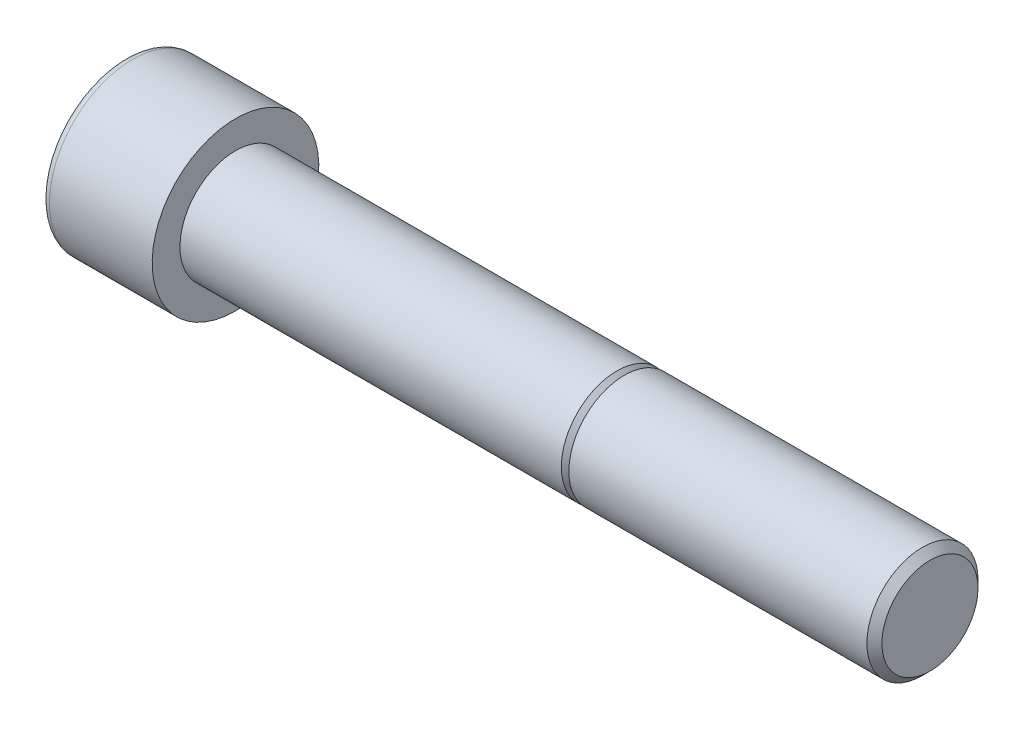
ISO-10303-21;
HEADER;
FILE_DESCRIPTION(('STEP AP214'),'2;1');
FILE_NAME('part.step','',(''),(''),'','','');
FILE_SCHEMA(('AUTOMOTIVE_DESIGN { 1 0 10303 214 1 1 1 1 }'));
ENDSEC;
DATA;
#1=APPLICATION_CONTEXT('core data for automotive mechanical design processes');
#2=APPLICATION_PROTOCOL_DEFINITION('international standard','automotive_design',2000,#1);
#3=PRODUCT_CONTEXT('',#1,'mechanical');
#4=PRODUCT('Part','Part','',(#3));
#5=PRODUCT_RELATED_PRODUCT_CATEGORY('part','',(#4));
#6=PRODUCT_DEFINITION_FORMATION('','',#4);
#7=PRODUCT_DEFINITION_CONTEXT('part definition',#1,'design');
#8=PRODUCT_DEFINITION('design','',#6,#7);
#9=PRODUCT_DEFINITION_SHAPE('','',#8);
#10=(LENGTH_UNIT() NAMED_UNIT(*) SI_UNIT(.MILLI.,.METRE.));
#11=(NAMED_UNIT(*) PLANE_ANGLE_UNIT() SI_UNIT($,.RADIAN.));
#12=(NAMED_UNIT(*) SI_UNIT($,.STERADIAN.) SOLID_ANGLE_UNIT());
#13=UNCERTAINTY_MEASURE_WITH_UNIT(LENGTH_MEASURE(1.E-05),#10,'distance_accuracy_value','');
#14=(GEOMETRIC_REPRESENTATION_CONTEXT(3) GLOBAL_UNCERTAINTY_ASSIGNED_CONTEXT((#13)) GLOBAL_UNIT_ASSIGNED_CONTEXT((#10,
#11,#12)) REPRESENTATION_CONTEXT('',''));
#15=CARTESIAN_POINT('',(0.,0.,0.));
#16=DIRECTION('',(0.,0.,1.));
#17=DIRECTION('',(1.,0.,0.));
#18=AXIS2_PLACEMENT_3D('',#15,#16,#17);
#19=CARTESIAN_POINT('',(80.,0.,0.));
#20=DIRECTION('',(-1.,0.,0.));
#21=DIRECTION('',(0.,-1.,0.));
#22=AXIS2_PLACEMENT_3D('',#19,#20,#21);
#23=CYLINDRICAL_SURFACE('',#22,8.);
#24=CARTESIAN_POINT('',(78.9175,0.,0.));
#25=DIRECTION('',(1.,0.,0.));
#26=DIRECTION('',(0.,1.,0.));
#27=AXIS2_PLACEMENT_3D('',#24,#25,#26);
#28=CIRCLE('',#27,8.);
#29=CARTESIAN_POINT('',(78.9175,8.,0.));
#30=VERTEX_POINT('',#29);
#31=EDGE_CURVE('E154',#30,#30,#28,.F.);
#32=ORIENTED_EDGE('',*,*,#31,.T.);
#33=EDGE_LOOP('',(#32));
#34=FACE_BOUND('',#33,.T.);
#35=CARTESIAN_POINT('',(36.,0.,0.));
#36=DIRECTION('',(-1.,0.,0.));
#37=DIRECTION('',(0.,-1.,0.));
#38=AXIS2_PLACEMENT_3D('',#35,#36,#37);
#39=CIRCLE('',#38,8.);
#40=CARTESIAN_POINT('',(36.,-8.,0.));
#41=VERTEX_POINT('',#40);
#42=EDGE_CURVE('E134',#41,#41,#39,.T.);
#43=ORIENTED_EDGE('',*,*,#42,.F.);
#44=EDGE_LOOP('',(#43));
#45=FACE_BOUND('',#44,.T.);
#46=ADVANCED_FACE('F32',(#34,#45),#23,.T.);
#47=CARTESIAN_POINT('',(80.,8.,0.));
#48=DIRECTION('',(1.,0.,0.));
#49=DIRECTION('',(0.,1.,0.));
#50=AXIS2_PLACEMENT_3D('',#47,#48,#49);
#51=PLANE('',#50);
#52=CARTESIAN_POINT('',(80.,0.,0.));
#53=DIRECTION('',(1.,0.,0.));
#54=DIRECTION('',(0.,1.,0.));
#55=AXIS2_PLACEMENT_3D('',#52,#53,#54);
#56=CIRCLE('',#55,6.91749999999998);
#57=CARTESIAN_POINT('',(80.,6.91749999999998,0.));
#58=VERTEX_POINT('',#57);
#59=EDGE_CURVE('E157',#58,#58,#56,.T.);
#60=ORIENTED_EDGE('',*,*,#59,.T.);
#61=EDGE_LOOP('',(#60));
#62=FACE_BOUND('',#61,.T.);
#63=ADVANCED_FACE('F174',(#62),#51,.T.);
#64=CARTESIAN_POINT('',(-36.,0.,0.));
#65=DIRECTION('',(-1.,0.,0.));
#66=DIRECTION('',(0.,-1.,0.));
#67=AXIS2_PLACEMENT_3D('',#64,#65,#66);
#68=PLANE('',#67);
#69=CARTESIAN_POINT('',(-36.,0.,0.));
#70=DIRECTION('',(-1.,0.,0.));
#71=DIRECTION('',(0.,-1.,0.));
#72=AXIS2_PLACEMENT_3D('',#69,#70,#71);
#73=CIRCLE('',#72,10.8);
#74=CARTESIAN_POINT('',(-36.,-10.8,0.));
#75=VERTEX_POINT('',#74);
#76=EDGE_CURVE('E40',#75,#75,#73,.T.);
#77=ORIENTED_EDGE('',*,*,#76,.T.);
#78=EDGE_LOOP('',(#77));
#79=FACE_BOUND('',#78,.T.);
#80=DIRECTION('',(0.,-1.,0.));
#81=VECTOR('',#80,1.);
#82=CARTESIAN_POINT('',(-36.,4.04145188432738,-7.));
#83=LINE('',#82,#81);
#84=CARTESIAN_POINT('',(-36.,4.04145188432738,-7.));
#85=VERTEX_POINT('',#84);
#86=CARTESIAN_POINT('',(-36.,-4.04145188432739,-7.));
#87=VERTEX_POINT('',#86);
#88=EDGE_CURVE('E47',#85,#87,#83,.T.);
#89=ORIENTED_EDGE('',*,*,#88,.F.);
#90=DIRECTION('',(0.,-0.5,-0.866025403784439));
#91=VECTOR('',#90,1.);
#92=CARTESIAN_POINT('',(-36.,8.08290376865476,0.));
#93=LINE('',#92,#91);
#94=CARTESIAN_POINT('',(-36.,8.08290376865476,0.));
#95=VERTEX_POINT('',#94);
#96=EDGE_CURVE('E130',#95,#85,#93,.T.);
#97=ORIENTED_EDGE('',*,*,#96,.F.);
#98=DIRECTION('',(0.,0.499999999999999,-0.866025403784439));
#99=VECTOR('',#98,1.);
#100=CARTESIAN_POINT('',(-36.,4.04145188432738,7.));
#101=LINE('',#100,#99);
#102=CARTESIAN_POINT('',(-36.,4.04145188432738,7.));
#103=VERTEX_POINT('',#102);
#104=EDGE_CURVE('E128',#103,#95,#101,.T.);
#105=ORIENTED_EDGE('',*,*,#104,.F.);
#106=DIRECTION('',(0.,1.,0.));
#107=VECTOR('',#106,1.);
#108=CARTESIAN_POINT('',(-36.,-4.04145188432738,7.));
#109=LINE('',#108,#107);
#110=CARTESIAN_POINT('',(-36.,-4.04145188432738,7.));
#111=VERTEX_POINT('',#110);
#112=EDGE_CURVE('E95',#111,#103,#109,.T.);
#113=ORIENTED_EDGE('',*,*,#112,.F.);
#114=DIRECTION('',(0.,0.5,0.866025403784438));
#115=VECTOR('',#114,1.);
#116=CARTESIAN_POINT('',(-36.,-8.08290376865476,0.));
#117=LINE('',#116,#115);
#118=CARTESIAN_POINT('',(-36.,-8.08290376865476,0.));
#119=VERTEX_POINT('',#118);
#120=EDGE_CURVE('E124',#119,#111,#117,.T.);
#121=ORIENTED_EDGE('',*,*,#120,.F.);
#122=DIRECTION('',(0.,-0.499999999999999,0.866025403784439));
#123=VECTOR('',#122,1.);
#124=CARTESIAN_POINT('',(-36.,-4.04145188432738,-7.));
#125=LINE('',#124,#123);
#126=EDGE_CURVE('E121',#87,#119,#125,.T.);
#127=ORIENTED_EDGE('',*,*,#126,.F.);
#128=EDGE_LOOP('',(#89,#97,#105,#113,#121,#127));
#129=FACE_BOUND('',#128,.T.);
#130=ADVANCED_FACE('F162',(#79,#129),#68,.T.);
#131=CARTESIAN_POINT('',(80.,0.,0.));
#132=DIRECTION('',(-1.,0.,0.));
#133=DIRECTION('',(0.,-1.,0.));
#134=AXIS2_PLACEMENT_3D('',#131,#132,#133);
#135=CYLINDRICAL_SURFACE('',#134,12.);
#136=CARTESIAN_POINT('',(-34.8,0.,0.));
#137=DIRECTION('',(-1.,0.,0.));
#138=DIRECTION('',(0.,-1.,0.));
#139=AXIS2_PLACEMENT_3D('',#136,#137,#138);
#140=CIRCLE('',#139,12.);
#141=CARTESIAN_POINT('',(-34.8,-12.,0.));
#142=VERTEX_POINT('',#141);
#143=EDGE_CURVE('E11',#142,#142,#140,.F.);
#144=ORIENTED_EDGE('',*,*,#143,.T.);
#145=EDGE_LOOP('',(#144));
#146=FACE_BOUND('',#145,.T.);
#147=CARTESIAN_POINT('',(-20.,0.,0.));
#148=DIRECTION('',(-1.,0.,0.));
#149=DIRECTION('',(0.,-1.,0.));
#150=AXIS2_PLACEMENT_3D('',#147,#148,#149);
#151=CIRCLE('',#150,12.);
#152=CARTESIAN_POINT('',(-20.,-12.,0.));
#153=VERTEX_POINT('',#152);
#154=EDGE_CURVE('E151',#153,#153,#151,.T.);
#155=ORIENTED_EDGE('',*,*,#154,.T.);
#156=EDGE_LOOP('',(#155));
#157=FACE_BOUND('',#156,.T.);
#158=ADVANCED_FACE('F186',(#146,#157),#135,.T.);
#159=CARTESIAN_POINT('',(-20.,12.,0.));
#160=DIRECTION('',(1.,0.,0.));
#161=DIRECTION('',(0.,1.,0.));
#162=AXIS2_PLACEMENT_3D('',#159,#160,#161);
#163=PLANE('',#162);
#164=CARTESIAN_POINT('',(-20.,0.,0.));
#165=DIRECTION('',(-1.,0.,0.));
#166=DIRECTION('',(0.,-1.,0.));
#167=AXIS2_PLACEMENT_3D('',#164,#165,#166);
#168=CIRCLE('',#167,8.00000000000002);
#169=CARTESIAN_POINT('',(-20.,-8.00000000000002,0.));
#170=VERTEX_POINT('',#169);
#171=EDGE_CURVE('E148',#170,#170,#168,.T.);
#172=ORIENTED_EDGE('',*,*,#171,.T.);
#173=EDGE_LOOP('',(#172));
#174=FACE_BOUND('',#173,.T.);
#175=ORIENTED_EDGE('',*,*,#154,.F.);
#176=EDGE_LOOP('',(#175));
#177=FACE_BOUND('',#176,.T.);
#178=ADVANCED_FACE('F189',(#174,#177),#163,.T.);
#179=CARTESIAN_POINT('',(80.,0.,0.));
#180=DIRECTION('',(-1.,0.,0.));
#181=DIRECTION('',(0.,-1.,0.));
#182=AXIS2_PLACEMENT_3D('',#179,#180,#181);
#183=CYLINDRICAL_SURFACE('',#182,8.00000000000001);
#184=CARTESIAN_POINT('',(34.9175,0.,0.));
#185=DIRECTION('',(-1.,0.,0.));
#186=DIRECTION('',(0.,-1.,0.));
#187=AXIS2_PLACEMENT_3D('',#184,#185,#186);
#188=CIRCLE('',#187,8.00000000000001);
#189=CARTESIAN_POINT('',(34.9175,-8.00000000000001,0.));
#190=VERTEX_POINT('',#189);
#191=EDGE_CURVE('E145',#190,#190,#188,.T.);
#192=ORIENTED_EDGE('',*,*,#191,.T.);
#193=EDGE_LOOP('',(#192));
#194=FACE_BOUND('',#193,.T.);
#195=ORIENTED_EDGE('',*,*,#171,.F.);
#196=EDGE_LOOP('',(#195));
#197=FACE_BOUND('',#196,.T.);
#198=ADVANCED_FACE('F193',(#194,#197),#183,.T.);
#199=CARTESIAN_POINT('',(34.9175,0.,0.));
#200=DIRECTION('',(-1.,0.,0.));
#201=DIRECTION('',(0.,-1.,0.));
#202=AXIS2_PLACEMENT_3D('',#199,#200,#201);
#203=CONICAL_SURFACE('',#202,8.00000000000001,0.785398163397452);
#204=CARTESIAN_POINT('',(36.,0.,0.));
#205=DIRECTION('',(-1.,0.,0.));
#206=DIRECTION('',(0.,-1.,0.));
#207=AXIS2_PLACEMENT_3D('',#204,#205,#206);
#208=CIRCLE('',#207,6.9175);
#209=CARTESIAN_POINT('',(36.,-6.9175,0.));
#210=VERTEX_POINT('',#209);
#211=EDGE_CURVE('E142',#210,#210,#208,.T.);
#212=ORIENTED_EDGE('',*,*,#211,.T.);
#213=EDGE_LOOP('',(#212));
#214=FACE_BOUND('',#213,.T.);
#215=ORIENTED_EDGE('',*,*,#191,.F.);
#216=EDGE_LOOP('',(#215));
#217=FACE_BOUND('',#216,.T.);
#218=ADVANCED_FACE('F197',(#214,#217),#203,.T.);
#219=CARTESIAN_POINT('',(36.,6.9175,0.));
#220=DIRECTION('',(-1.,0.,0.));
#221=DIRECTION('',(0.,-1.,0.));
#222=AXIS2_PLACEMENT_3D('',#219,#220,#221);
#223=PLANE('',#222);
#224=ORIENTED_EDGE('',*,*,#42,.T.);
#225=EDGE_LOOP('',(#224));
#226=FACE_BOUND('',#225,.T.);
#227=ORIENTED_EDGE('',*,*,#211,.F.);
#228=EDGE_LOOP('',(#227));
#229=FACE_BOUND('',#228,.T.);
#230=ADVANCED_FACE('F201',(#226,#229),#223,.T.);
#231=CARTESIAN_POINT('',(-28.,4.04145188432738,-7.));
#232=DIRECTION('',(0.,0.,-1.));
#233=DIRECTION('',(-1.,0.,0.));
#234=AXIS2_PLACEMENT_3D('',#231,#232,#233);
#235=PLANE('',#234);
#236=ORIENTED_EDGE('',*,*,#88,.T.);
#237=DIRECTION('',(-1.,0.,0.));
#238=VECTOR('',#237,1.);
#239=CARTESIAN_POINT('',(-28.,-4.04145188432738,-7.));
#240=LINE('',#239,#238);
#241=CARTESIAN_POINT('',(-28.,-4.04145188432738,-7.));
#242=VERTEX_POINT('',#241);
#243=EDGE_CURVE('E77',#242,#87,#240,.T.);
#244=ORIENTED_EDGE('',*,*,#243,.F.);
#245=DIRECTION('',(0.,-1.,0.));
#246=VECTOR('',#245,1.);
#247=CARTESIAN_POINT('',(-28.,4.04145188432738,-7.));
#248=LINE('',#247,#246);
#249=CARTESIAN_POINT('',(-28.,4.04145188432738,-7.));
#250=VERTEX_POINT('',#249);
#251=EDGE_CURVE('E132',#250,#242,#248,.T.);
#252=ORIENTED_EDGE('',*,*,#251,.F.);
#253=DIRECTION('',(-1.,0.,0.));
#254=VECTOR('',#253,1.);
#255=CARTESIAN_POINT('',(-28.,4.04145188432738,-7.));
#256=LINE('',#255,#254);
#257=EDGE_CURVE('E55',#250,#85,#256,.T.);
#258=ORIENTED_EDGE('',*,*,#257,.T.);
#259=EDGE_LOOP('',(#236,#244,#252,#258));
#260=FACE_BOUND('',#259,.T.);
#261=ADVANCED_FACE('F205',(#260),#235,.F.);
#262=CARTESIAN_POINT('',(-28.,8.08290376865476,0.));
#263=DIRECTION('',(0.,0.866025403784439,-0.5));
#264=DIRECTION('',(0.,0.5,0.866025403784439));
#265=AXIS2_PLACEMENT_3D('',#262,#263,#264);
#266=PLANE('',#265);
#267=ORIENTED_EDGE('',*,*,#96,.T.);
#268=ORIENTED_EDGE('',*,*,#257,.F.);
#269=DIRECTION('',(0.,-0.5,-0.866025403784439));
#270=VECTOR('',#269,1.);
#271=CARTESIAN_POINT('',(-28.,8.08290376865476,0.));
#272=LINE('',#271,#270);
#273=CARTESIAN_POINT('',(-28.,8.08290376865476,0.));
#274=VERTEX_POINT('',#273);
#275=EDGE_CURVE('E107',#274,#250,#272,.T.);
#276=ORIENTED_EDGE('',*,*,#275,.F.);
#277=DIRECTION('',(-1.,0.,0.));
#278=VECTOR('',#277,1.);
#279=CARTESIAN_POINT('',(-28.,8.08290376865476,0.));
#280=LINE('',#279,#278);
#281=EDGE_CURVE('E99',#274,#95,#280,.T.);
#282=ORIENTED_EDGE('',*,*,#281,.T.);
#283=EDGE_LOOP('',(#267,#268,#276,#282));
#284=FACE_BOUND('',#283,.T.);
#285=ADVANCED_FACE('F209',(#284),#266,.F.);
#286=CARTESIAN_POINT('',(-28.,4.04145188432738,7.));
#287=DIRECTION('',(0.,0.866025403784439,0.5));
#288=DIRECTION('',(0.,-0.499999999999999,0.866025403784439));
#289=AXIS2_PLACEMENT_3D('',#286,#287,#288);
#290=PLANE('',#289);
#291=ORIENTED_EDGE('',*,*,#104,.T.);
#292=ORIENTED_EDGE('',*,*,#281,.F.);
#293=DIRECTION('',(0.,0.499999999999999,-0.866025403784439));
#294=VECTOR('',#293,1.);
#295=CARTESIAN_POINT('',(-28.,4.04145188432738,7.));
#296=LINE('',#295,#294);
#297=CARTESIAN_POINT('',(-28.,4.04145188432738,7.));
#298=VERTEX_POINT('',#297);
#299=EDGE_CURVE('E103',#298,#274,#296,.T.);
#300=ORIENTED_EDGE('',*,*,#299,.F.);
#301=DIRECTION('',(-1.,0.,0.));
#302=VECTOR('',#301,1.);
#303=CARTESIAN_POINT('',(-28.,4.04145188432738,7.));
#304=LINE('',#303,#302);
#305=EDGE_CURVE('E88',#298,#103,#304,.T.);
#306=ORIENTED_EDGE('',*,*,#305,.T.);
#307=EDGE_LOOP('',(#291,#292,#300,#306));
#308=FACE_BOUND('',#307,.T.);
#309=ADVANCED_FACE('F104',(#308),#290,.F.);
#310=CARTESIAN_POINT('',(-28.,-4.04145188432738,7.));
#311=DIRECTION('',(0.,0.,1.));
#312=DIRECTION('',(1.,0.,0.));
#313=AXIS2_PLACEMENT_3D('',#310,#311,#312);
#314=PLANE('',#313);
#315=ORIENTED_EDGE('',*,*,#112,.T.);
#316=ORIENTED_EDGE('',*,*,#305,.F.);
#317=DIRECTION('',(0.,1.,0.));
#318=VECTOR('',#317,1.);
#319=CARTESIAN_POINT('',(-28.,-4.04145188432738,7.));
#320=LINE('',#319,#318);
#321=CARTESIAN_POINT('',(-28.,-4.04145188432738,7.));
#322=VERTEX_POINT('',#321);
#323=EDGE_CURVE('E92',#322,#298,#320,.T.);
#324=ORIENTED_EDGE('',*,*,#323,.F.);
#325=DIRECTION('',(-1.,0.,0.));
#326=VECTOR('',#325,1.);
#327=CARTESIAN_POINT('',(-28.,-4.04145188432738,7.));
#328=LINE('',#327,#326);
#329=EDGE_CURVE('E100',#322,#111,#328,.T.);
#330=ORIENTED_EDGE('',*,*,#329,.T.);
#331=EDGE_LOOP('',(#315,#316,#324,#330));
#332=FACE_BOUND('',#331,.T.);
#333=ADVANCED_FACE('F90',(#332),#314,.F.);
#334=CARTESIAN_POINT('',(-28.,-8.08290376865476,0.));
#335=DIRECTION('',(0.,-0.866025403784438,0.5));
#336=DIRECTION('',(0.,-0.5,-0.866025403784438));
#337=AXIS2_PLACEMENT_3D('',#334,#335,#336);
#338=PLANE('',#337);
#339=ORIENTED_EDGE('',*,*,#120,.T.);
#340=ORIENTED_EDGE('',*,*,#329,.F.);
#341=DIRECTION('',(0.,0.5,0.866025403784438));
#342=VECTOR('',#341,1.);
#343=CARTESIAN_POINT('',(-28.,-8.08290376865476,0.));
#344=LINE('',#343,#342);
#345=CARTESIAN_POINT('',(-28.,-8.08290376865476,0.));
#346=VERTEX_POINT('',#345);
#347=EDGE_CURVE('E113',#346,#322,#344,.T.);
#348=ORIENTED_EDGE('',*,*,#347,.F.);
#349=DIRECTION('',(-1.,0.,0.));
#350=VECTOR('',#349,1.);
#351=CARTESIAN_POINT('',(-28.,-8.08290376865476,0.));
#352=LINE('',#351,#350);
#353=EDGE_CURVE('E137',#346,#119,#352,.T.);
#354=ORIENTED_EDGE('',*,*,#353,.T.);
#355=EDGE_LOOP('',(#339,#340,#348,#354));
#356=FACE_BOUND('',#355,.T.);
#357=ADVANCED_FACE('F213',(#356),#338,.F.);
#358=CARTESIAN_POINT('',(-28.,-4.04145188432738,-7.));
#359=DIRECTION('',(0.,-0.866025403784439,-0.5));
#360=DIRECTION('',(0.,0.499999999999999,-0.866025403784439));
#361=AXIS2_PLACEMENT_3D('',#358,#359,#360);
#362=PLANE('',#361);
#363=ORIENTED_EDGE('',*,*,#126,.T.);
#364=ORIENTED_EDGE('',*,*,#353,.F.);
#365=DIRECTION('',(0.,-0.499999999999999,0.866025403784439));
#366=VECTOR('',#365,1.);
#367=CARTESIAN_POINT('',(-28.,-4.04145188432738,-7.));
#368=LINE('',#367,#366);
#369=EDGE_CURVE('E115',#242,#346,#368,.T.);
#370=ORIENTED_EDGE('',*,*,#369,.F.);
#371=ORIENTED_EDGE('',*,*,#243,.T.);
#372=EDGE_LOOP('',(#363,#364,#370,#371));
#373=FACE_BOUND('',#372,.T.);
#374=ADVANCED_FACE('F210',(#373),#362,.F.);
#375=CARTESIAN_POINT('',(-28.,-4.04145188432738,-7.));
#376=DIRECTION('',(-1.,0.,0.));
#377=DIRECTION('',(0.,0.,1.));
#378=AXIS2_PLACEMENT_3D('',#375,#376,#377);
#379=PLANE('',#378);
#380=ORIENTED_EDGE('',*,*,#251,.T.);
#381=ORIENTED_EDGE('',*,*,#369,.T.);
#382=ORIENTED_EDGE('',*,*,#347,.T.);
#383=ORIENTED_EDGE('',*,*,#323,.T.);
#384=ORIENTED_EDGE('',*,*,#299,.T.);
#385=ORIENTED_EDGE('',*,*,#275,.T.);
#386=EDGE_LOOP('',(#380,#381,#382,#383,#384,#385));
#387=FACE_BOUND('',#386,.T.);
#388=ADVANCED_FACE('F110',(#387),#379,.T.);
#389=CARTESIAN_POINT('',(78.9175,0.,0.));
#390=DIRECTION('',(-1.,0.,0.));
#391=DIRECTION('',(0.,-1.,0.));
#392=AXIS2_PLACEMENT_3D('',#389,#390,#391);
#393=CONICAL_SURFACE('',#392,8.,0.785398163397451);
#394=ORIENTED_EDGE('',*,*,#59,.F.);
#395=EDGE_LOOP('',(#394));
#396=FACE_BOUND('',#395,.T.);
#397=ORIENTED_EDGE('',*,*,#31,.F.);
#398=EDGE_LOOP('',(#397));
#399=FACE_BOUND('',#398,.T.);
#400=ADVANCED_FACE('F166',(#396,#399),#393,.T.);
#401=CARTESIAN_POINT('',(-34.8,0.,0.));
#402=DIRECTION('',(-1.,0.,0.));
#403=DIRECTION('',(0.,-1.,0.));
#404=AXIS2_PLACEMENT_3D('',#401,#402,#403);
#405=TOROIDAL_SURFACE('',#404,10.8,1.2);
#406=ORIENTED_EDGE('',*,*,#143,.F.);
#407=EDGE_LOOP('',(#406));
#408=FACE_BOUND('',#407,.T.);
#409=ORIENTED_EDGE('',*,*,#76,.F.);
#410=EDGE_LOOP('',(#409));
#411=FACE_BOUND('',#410,.T.);
#412=ADVANCED_FACE('F34',(#408,#411),#405,.T.);
#413=CLOSED_SHELL('',(#46,#63,#130,#158,#178,#198,#218,#230,#261,#285,#309,#333,#357,#374,#388,
#400,#412));
#414=MANIFOLD_SOLID_BREP('B2',#413);
#415=ADVANCED_BREP_SHAPE_REPRESENTATION('',(#18,#414),#14);
#416=SHAPE_DEFINITION_REPRESENTATION(#9,#415);
ENDSEC;
END-ISO-10303-21;
